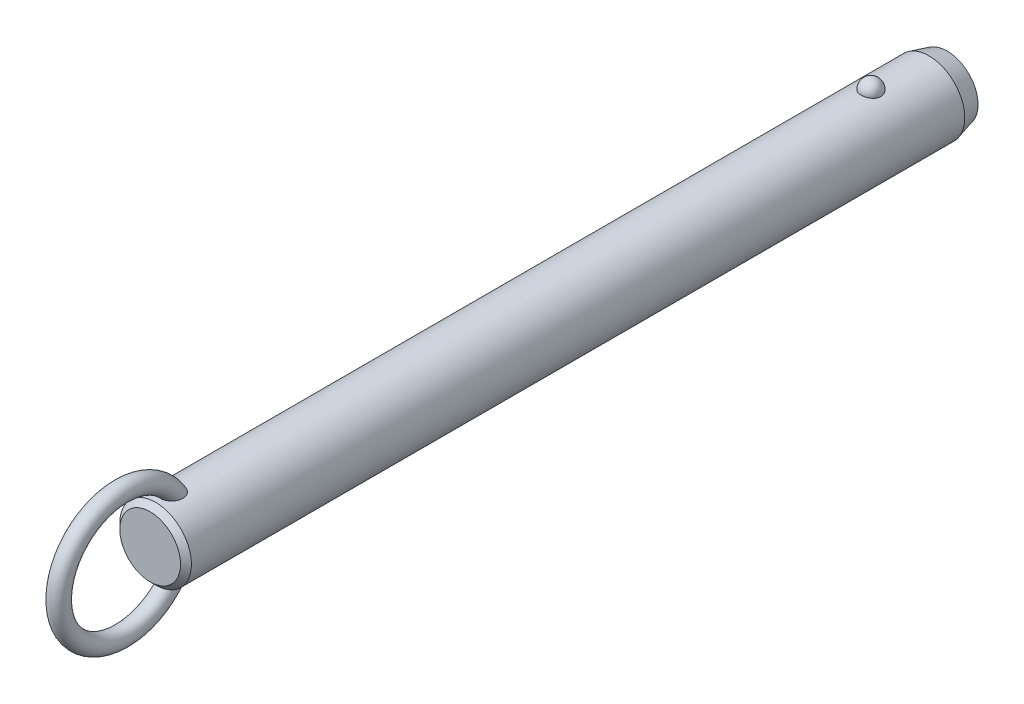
ISO-10303-21;
HEADER;
FILE_DESCRIPTION(('STEP AP214'),'2;1');
FILE_NAME('part.step','',(''),(''),'','','');
FILE_SCHEMA(('AUTOMOTIVE_DESIGN { 1 0 10303 214 1 1 1 1 }'));
ENDSEC;
DATA;
#1=APPLICATION_CONTEXT('core data for automotive mechanical design processes');
#2=APPLICATION_PROTOCOL_DEFINITION('international standard','automotive_design',2000,#1);
#3=PRODUCT_CONTEXT('',#1,'mechanical');
#4=PRODUCT('Part','Part','',(#3));
#5=PRODUCT_RELATED_PRODUCT_CATEGORY('part','',(#4));
#6=PRODUCT_DEFINITION_FORMATION('','',#4);
#7=PRODUCT_DEFINITION_CONTEXT('part definition',#1,'design');
#8=PRODUCT_DEFINITION('design','',#6,#7);
#9=PRODUCT_DEFINITION_SHAPE('','',#8);
#10=(LENGTH_UNIT() NAMED_UNIT(*) SI_UNIT(.MILLI.,.METRE.));
#11=(NAMED_UNIT(*) PLANE_ANGLE_UNIT() SI_UNIT($,.RADIAN.));
#12=(NAMED_UNIT(*) SI_UNIT($,.STERADIAN.) SOLID_ANGLE_UNIT());
#13=UNCERTAINTY_MEASURE_WITH_UNIT(LENGTH_MEASURE(1.E-05),#10,'distance_accuracy_value','');
#14=(GEOMETRIC_REPRESENTATION_CONTEXT(3) GLOBAL_UNCERTAINTY_ASSIGNED_CONTEXT((#13)) GLOBAL_UNIT_ASSIGNED_CONTEXT((#10,
#11,#12)) REPRESENTATION_CONTEXT('',''));
#15=CARTESIAN_POINT('',(0.,0.,0.));
#16=DIRECTION('',(0.,0.,1.));
#17=DIRECTION('',(1.,0.,0.));
#18=AXIS2_PLACEMENT_3D('',#15,#16,#17);
#19=CARTESIAN_POINT('',(0.,0.,147.3));
#20=DIRECTION('',(0.,0.,-1.));
#21=DIRECTION('',(-1.,0.,0.));
#22=AXIS2_PLACEMENT_3D('',#19,#20,#21);
#23=CYLINDRICAL_SURFACE('',#22,7.9);
#24=CARTESIAN_POINT('',(2.1785689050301,7.59367088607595,-2.19999999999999));
#25=CARTESIAN_POINT('',(2.17856679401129,7.59367269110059,-2.07701843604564));
#26=CARTESIAN_POINT('',(2.16853481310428,7.59657145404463,-1.95401006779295));
#27=CARTESIAN_POINT('',(2.12864689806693,7.607843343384,-1.71147811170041));
#28=CARTESIAN_POINT('',(2.09878338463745,7.61621856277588,-1.59195587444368));
#29=CARTESIAN_POINT('',(2.0199931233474,7.63749180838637,-1.3598563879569));
#30=CARTESIAN_POINT('',(1.97107475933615,7.6503878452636,-1.24727610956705));
#31=CARTESIAN_POINT('',(1.85539377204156,7.67926115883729,-1.03213234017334));
#32=CARTESIAN_POINT('',(1.78863158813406,7.69523835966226,-0.929568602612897));
#33=CARTESIAN_POINT('',(1.63856494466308,7.7285848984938,-0.736786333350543));
#34=CARTESIAN_POINT('',(1.55518140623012,7.7459606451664,-0.646630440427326));
#35=CARTESIAN_POINT('',(1.37422937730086,7.78009978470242,-0.481747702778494));
#36=CARTESIAN_POINT('',(1.27666086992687,7.79686317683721,-0.407020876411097));
#37=CARTESIAN_POINT('',(1.07024728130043,7.82786153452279,-0.275278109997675));
#38=CARTESIAN_POINT('',(0.961434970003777,7.84210353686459,-0.218212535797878));
#39=CARTESIAN_POINT('',(0.735351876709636,7.86652194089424,-0.123146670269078));
#40=CARTESIAN_POINT('',(0.618082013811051,7.87669878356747,-0.085144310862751));
#41=CARTESIAN_POINT('',(0.380637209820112,7.89170521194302,-0.0298158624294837));
#42=CARTESIAN_POINT('',(0.260550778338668,7.89662650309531,-0.0121347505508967));
#43=CARTESIAN_POINT('',(0.0190117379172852,7.90090003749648,0.00324379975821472));
#44=CARTESIAN_POINT('',(-0.102440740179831,7.90025280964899,0.00094313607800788));
#45=CARTESIAN_POINT('',(-0.341452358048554,7.89351056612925,-0.0233955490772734));
#46=CARTESIAN_POINT('',(-0.459042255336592,7.88749257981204,-0.0451545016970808));
#47=CARTESIAN_POINT('',(-0.688796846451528,7.87075812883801,-0.107408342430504));
#48=CARTESIAN_POINT('',(-0.800961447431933,7.86004158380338,-0.147903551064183));
#49=CARTESIAN_POINT('',(-1.01743634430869,7.83497131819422,-0.246799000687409));
#50=CARTESIAN_POINT('',(-1.12169791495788,7.82059709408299,-0.305300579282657));
#51=CARTESIAN_POINT('',(-1.31891765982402,7.78976470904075,-0.438549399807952));
#52=CARTESIAN_POINT('',(-1.41187469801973,7.77330633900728,-0.513298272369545));
#53=CARTESIAN_POINT('',(-1.58577142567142,7.73972434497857,-0.678622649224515));
#54=CARTESIAN_POINT('',(-1.66645140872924,7.72259402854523,-0.769470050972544));
#55=CARTESIAN_POINT('',(-1.81161503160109,7.68983776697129,-0.963538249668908));
#56=CARTESIAN_POINT('',(-1.87609753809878,7.6742119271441,-1.06675991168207));
#57=CARTESIAN_POINT('',(-1.98790138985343,7.6460202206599,-1.28401170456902));
#58=CARTESIAN_POINT('',(-2.03501994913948,7.63349104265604,-1.39815107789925));
#59=CARTESIAN_POINT('',(-2.10986724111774,7.6131449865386,-1.63301784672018));
#60=CARTESIAN_POINT('',(-2.1375965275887,7.60532797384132,-1.75374505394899));
#61=CARTESIAN_POINT('',(-2.17289256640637,7.5953195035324,-1.99782562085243));
#62=CARTESIAN_POINT('',(-2.18054294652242,7.59310471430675,-2.12116592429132));
#63=CARTESIAN_POINT('',(-2.17572919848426,7.59448538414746,-2.36741799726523));
#64=CARTESIAN_POINT('',(-2.1632656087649,7.59808068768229,-2.49032977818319));
#65=CARTESIAN_POINT('',(-2.11865035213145,7.61064035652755,-2.73161015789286));
#66=CARTESIAN_POINT('',(-2.08659579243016,7.61957823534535,-2.84999812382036));
#67=CARTESIAN_POINT('',(-2.00367799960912,7.64179982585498,-3.07955956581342));
#68=CARTESIAN_POINT('',(-1.9528140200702,7.65508371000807,-3.19073275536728));
#69=CARTESIAN_POINT('',(-1.83321113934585,7.68460381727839,-3.40337899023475));
#70=CARTESIAN_POINT('',(-1.76437735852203,7.70085556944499,-3.50479651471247));
#71=CARTESIAN_POINT('',(-1.61069526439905,7.73445734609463,-3.69446912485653));
#72=CARTESIAN_POINT('',(-1.52584634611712,7.75180741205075,-3.78272371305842));
#73=CARTESIAN_POINT('',(-1.34198059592,7.78574608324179,-3.94393987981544));
#74=CARTESIAN_POINT('',(-1.24291308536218,7.80233167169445,-4.01684434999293));
#75=CARTESIAN_POINT('',(-1.03352039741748,7.83281625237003,-4.14489386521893));
#76=CARTESIAN_POINT('',(-0.92319600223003,7.84671543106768,-4.20004014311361));
#77=CARTESIAN_POINT('',(-0.695822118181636,7.87011575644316,-4.29042017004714));
#78=CARTESIAN_POINT('',(-0.578872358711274,7.87966903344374,-4.32589112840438));
#79=CARTESIAN_POINT('',(-0.340410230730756,7.8935652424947,-4.37692226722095));
#80=CARTESIAN_POINT('',(-0.218898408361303,7.89790879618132,-4.39248482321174));
#81=CARTESIAN_POINT('',(0.0228107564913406,7.90087453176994,-4.40314405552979));
#82=CARTESIAN_POINT('',(0.142990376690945,7.89960185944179,-4.39861683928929));
#83=CARTESIAN_POINT('',(0.380829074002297,7.89171262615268,-4.37008293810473));
#84=CARTESIAN_POINT('',(0.498488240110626,7.8850962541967,-4.34607694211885));
#85=CARTESIAN_POINT('',(0.727535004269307,7.86726442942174,-4.27939317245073));
#86=CARTESIAN_POINT('',(0.838944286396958,7.85606616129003,-4.236785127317));
#87=CARTESIAN_POINT('',(1.05295421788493,7.83025654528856,-4.13408348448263));
#88=CARTESIAN_POINT('',(1.15555431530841,7.81564498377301,-4.07398879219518));
#89=CARTESIAN_POINT('',(1.35076763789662,7.7843022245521,-3.93687432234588));
#90=CARTESIAN_POINT('',(1.4432046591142,7.76754209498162,-3.85961036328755));
#91=CARTESIAN_POINT('',(1.6139111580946,7.73387857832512,-3.69076949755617));
#92=CARTESIAN_POINT('',(1.6921781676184,7.71697516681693,-3.59919010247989));
#93=CARTESIAN_POINT('',(1.83380875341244,7.6845643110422,-3.40247278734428));
#94=CARTESIAN_POINT('',(1.89689280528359,7.66908588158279,-3.29712873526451));
#95=CARTESIAN_POINT('',(2.0047823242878,7.64159441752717,-3.07707931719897));
#96=CARTESIAN_POINT('',(2.0495945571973,7.62958010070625,-2.96237743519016));
#97=CARTESIAN_POINT('',(2.11580183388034,7.61146617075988,-2.74040519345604));
#98=CARTESIAN_POINT('',(2.13929812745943,7.60484503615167,-2.63379846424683));
#99=CARTESIAN_POINT('',(2.17068242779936,7.59594664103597,-2.41813481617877));
#100=CARTESIAN_POINT('',(2.17857077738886,7.59366928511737,-2.30907795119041));
#101=CARTESIAN_POINT('',(2.1785689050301,7.59367088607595,-2.19999999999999));
#102=B_SPLINE_CURVE_WITH_KNOTS('',3,(#24,#25,#26,#27,#28,#29,#30,#31,#32,#33,#34,#35,#36,#37,
#38,#39,#40,#41,#42,#43,#44,#45,#46,#47,#48,#49,#50,#51,#52,#53,#54,#55,#56,#57,#58,#59,#60,#61,
#62,#63,#64,#65,#66,#67,#68,#69,#70,#71,#72,#73,#74,#75,#76,#77,#78,#79,#80,#81,#82,#83,#84,#85,
#86,#87,#88,#89,#90,#91,#92,#93,#94,#95,#96,#97,#98,#99,#100,#101),.UNSPECIFIED.,.T.,.F.,(4,2,2,
2,2,2,2,2,2,2,2,2,2,2,2,2,2,2,2,2,2,2,2,2,2,2,2,2,2,2,2,2,2,2,2,2,2,2,4),(0.,0.368552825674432,
0.737246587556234,1.10577831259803,1.4743009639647,1.8446206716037,2.21494081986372,
2.5842105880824,2.95344028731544,3.31611630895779,3.67875788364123,4.03628044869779,
4.39380913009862,4.75338791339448,5.11300280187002,5.47939989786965,5.8458226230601,
6.21639834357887,6.58696347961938,6.95598276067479,7.32499216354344,7.69218715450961,
8.0593967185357,8.42858578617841,8.79778880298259,9.16834203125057,9.5388695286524,
9.90482699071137,10.2707407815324,10.6298333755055,10.9889132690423,11.3466585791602,
11.7044262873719,12.0676511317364,12.4309391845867,12.8004764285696,13.1698767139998,
13.4967701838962,13.8236564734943),.UNSPECIFIED.);
#103=CARTESIAN_POINT('',(2.1785689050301,7.59367088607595,-2.19999999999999));
#104=VERTEX_POINT('',#103);
#105=EDGE_CURVE('E41',#104,#104,#102,.T.);
#106=ORIENTED_EDGE('',*,*,#105,.T.);
#107=EDGE_LOOP('',(#106));
#108=FACE_BOUND('',#107,.T.);
#109=CARTESIAN_POINT('',(0.,0.,155.62));
#110=DIRECTION('',(0.,0.,1.));
#111=DIRECTION('',(1.,0.,0.));
#112=AXIS2_PLACEMENT_3D('',#109,#110,#111);
#113=CIRCLE('',#112,7.9);
#114=CARTESIAN_POINT('',(7.9,0.,155.62));
#115=VERTEX_POINT('',#114);
#116=EDGE_CURVE('E10',#115,#115,#113,.F.);
#117=ORIENTED_EDGE('',*,*,#116,.T.);
#118=EDGE_LOOP('',(#117));
#119=FACE_BOUND('',#118,.T.);
#120=CARTESIAN_POINT('',(-0.630969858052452,-7.87476203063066,149.512432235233));
#121=CARTESIAN_POINT('',(-0.734180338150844,-7.86648998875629,149.547285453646));
#122=CARTESIAN_POINT('',(-0.834476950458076,-7.85639291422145,149.590816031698));
#123=CARTESIAN_POINT('',(-1.02620356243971,-7.83366343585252,149.694094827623));
#124=CARTESIAN_POINT('',(-1.1176141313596,-7.82102565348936,149.753877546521));
#125=CARTESIAN_POINT('',(-1.28877277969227,-7.79464922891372,149.887839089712));
#126=CARTESIAN_POINT('',(-1.36854014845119,-7.7809124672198,149.961993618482));
#127=CARTESIAN_POINT('',(-1.51461521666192,-7.75380398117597,150.122494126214));
#128=CARTESIAN_POINT('',(-1.58092966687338,-7.74043207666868,150.208833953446));
#129=CARTESIAN_POINT('',(-1.70019064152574,-7.7151252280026,150.392978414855));
#130=CARTESIAN_POINT('',(-1.75284037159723,-7.70322473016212,150.490979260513));
#131=CARTESIAN_POINT('',(-1.84263464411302,-7.68224112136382,150.694102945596));
#132=CARTESIAN_POINT('',(-1.87977299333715,-7.6731591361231,150.799228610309));
#133=CARTESIAN_POINT('',(-1.94152728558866,-7.65777930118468,151.023284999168));
#134=CARTESIAN_POINT('',(-1.96475471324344,-7.65179654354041,151.142616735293));
#135=CARTESIAN_POINT('',(-1.99449499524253,-7.64409642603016,151.38342986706));
#136=CARTESIAN_POINT('',(-2.0010005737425,-7.64238092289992,151.504912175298));
#137=CARTESIAN_POINT('',(-1.99856014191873,-7.64302120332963,151.768340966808));
#138=CARTESIAN_POINT('',(-1.98680021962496,-7.64611845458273,151.91025654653));
#139=CARTESIAN_POINT('',(-1.94457772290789,-7.65696186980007,152.191118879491));
#140=CARTESIAN_POINT('',(-1.91409393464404,-7.66471330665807,152.330062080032));
#141=CARTESIAN_POINT('',(-1.82768670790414,-7.68582947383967,152.631939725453));
#142=CARTESIAN_POINT('',(-1.76772963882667,-7.70003779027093,152.793686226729));
#143=CARTESIAN_POINT('',(-1.65998501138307,-7.72371550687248,153.027695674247));
#144=CARTESIAN_POINT('',(-1.621079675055,-7.73200670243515,153.104297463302));
#145=CARTESIAN_POINT('',(-1.53727726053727,-7.74910377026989,153.254079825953));
#146=CARTESIAN_POINT('',(-1.49238215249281,-7.75790947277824,153.327261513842));
#147=CARTESIAN_POINT('',(-1.37397050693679,-7.77993338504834,153.50288382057));
#148=CARTESIAN_POINT('',(-1.29690364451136,-7.79328473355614,153.602955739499));
#149=CARTESIAN_POINT('',(-1.1288548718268,-7.81939266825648,153.790714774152));
#150=CARTESIAN_POINT('',(-1.0378992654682,-7.83215032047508,153.878424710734));
#151=CARTESIAN_POINT('',(-0.86953281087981,-7.85231710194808,154.013414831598));
#152=CARTESIAN_POINT('',(-0.795716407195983,-7.86021093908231,154.065076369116));
#153=CARTESIAN_POINT('',(-0.640813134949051,-7.87434920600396,154.156381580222));
#154=CARTESIAN_POINT('',(-0.559737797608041,-7.88059619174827,154.19604389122));
#155=CARTESIAN_POINT('',(-0.406456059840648,-7.88984116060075,154.254300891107));
#156=CARTESIAN_POINT('',(-0.335227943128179,-7.89321892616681,154.275384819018));
#157=CARTESIAN_POINT('',(-0.190193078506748,-7.89804235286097,154.30541418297));
#158=CARTESIAN_POINT('',(-0.11638863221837,-7.89948969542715,154.314370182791));
#159=CARTESIAN_POINT('',(0.0318414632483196,-7.90028409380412,154.319291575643));
#160=CARTESIAN_POINT('',(0.106268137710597,-7.89962640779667,154.315227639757));
#161=CARTESIAN_POINT('',(0.253290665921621,-7.8962818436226,154.294461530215));
#162=CARTESIAN_POINT('',(0.325885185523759,-7.8935935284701,154.277750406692));
#163=CARTESIAN_POINT('',(0.481441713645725,-7.88577340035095,154.228738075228));
#164=CARTESIAN_POINT('',(0.563611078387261,-7.88026321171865,154.194005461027));
#165=CARTESIAN_POINT('',(0.721129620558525,-7.86741729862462,154.111796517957));
#166=CARTESIAN_POINT('',(0.796466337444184,-7.86007832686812,154.064297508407));
#167=CARTESIAN_POINT('',(0.971456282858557,-7.84073285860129,153.936513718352));
#168=CARTESIAN_POINT('',(1.06719686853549,-7.82809461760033,153.851004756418));
#169=CARTESIAN_POINT('',(1.24418921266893,-7.80192439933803,153.666232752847));
#170=CARTESIAN_POINT('',(1.32540832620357,-7.78839049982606,153.566939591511));
#171=CARTESIAN_POINT('',(1.45199971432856,-7.76559693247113,153.389576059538));
#172=CARTESIAN_POINT('',(1.50085649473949,-7.75626094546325,153.313954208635));
#173=CARTESIAN_POINT('',(1.59197749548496,-7.7380727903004,153.158742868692));
#174=CARTESIAN_POINT('',(1.63423919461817,-7.72922080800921,153.079151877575));
#175=CARTESIAN_POINT('',(1.71222612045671,-7.71231959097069,152.916664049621));
#176=CARTESIAN_POINT('',(1.74794516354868,-7.70427111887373,152.833764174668));
#177=CARTESIAN_POINT('',(1.81270113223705,-7.68929240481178,152.6652967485));
#178=CARTESIAN_POINT('',(1.84173789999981,-7.68236218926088,152.579729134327));
#179=CARTESIAN_POINT('',(1.89322698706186,-7.6698375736,152.40528702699));
#180=CARTESIAN_POINT('',(1.91558744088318,-7.66426199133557,152.316383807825));
#181=CARTESIAN_POINT('',(1.95281367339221,-7.65485915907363,152.136969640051));
#182=CARTESIAN_POINT('',(1.96767946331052,-7.65103190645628,152.046458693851));
#183=CARTESIAN_POINT('',(2.00021456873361,-7.64262981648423,151.773732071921));
#184=CARTESIAN_POINT('',(2.00600691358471,-7.6410871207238,151.589709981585));
#185=CARTESIAN_POINT('',(1.98445334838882,-7.64669564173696,151.276501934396));
#186=CARTESIAN_POINT('',(1.96607186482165,-7.65149688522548,151.146618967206));
#187=CARTESIAN_POINT('',(1.90884967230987,-7.6659762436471,150.891632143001));
#188=CARTESIAN_POINT('',(1.87002101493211,-7.67565148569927,150.766525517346));
#189=CARTESIAN_POINT('',(1.77063986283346,-7.69918471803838,150.52454013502));
#190=CARTESIAN_POINT('',(1.70993724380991,-7.71307150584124,150.407725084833));
#191=CARTESIAN_POINT('',(1.56733070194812,-7.74330306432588,150.188144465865));
#192=CARTESIAN_POINT('',(1.48543692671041,-7.75964665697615,150.085372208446));
#193=CARTESIAN_POINT('',(1.31346177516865,-7.79047523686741,149.909380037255));
#194=CARTESIAN_POINT('',(1.22547278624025,-7.80495298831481,149.834106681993));
#195=CARTESIAN_POINT('',(1.03724352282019,-7.83218597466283,149.700486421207));
#196=CARTESIAN_POINT('',(0.937008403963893,-7.84494192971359,149.642132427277));
#197=CARTESIAN_POINT('',(0.733599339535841,-7.86649045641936,149.547027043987));
#198=CARTESIAN_POINT('',(0.630941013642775,-7.87547134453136,149.509210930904));
#199=CARTESIAN_POINT('',(0.420465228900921,-7.88950708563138,149.451116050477));
#200=CARTESIAN_POINT('',(0.312645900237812,-7.89456050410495,149.43084369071));
#201=CARTESIAN_POINT('',(0.0960869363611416,-7.9001518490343,149.408455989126));
#202=CARTESIAN_POINT('',(-0.012634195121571,-7.90073226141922,149.406169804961));
#203=CARTESIAN_POINT('',(-0.228766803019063,-7.89742350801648,149.419367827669));
#204=CARTESIAN_POINT('',(-0.336180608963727,-7.89354403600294,149.434813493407));
#205=CARTESIAN_POINT('',(-0.473410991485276,-7.88586871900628,149.466217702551));
#206=CARTESIAN_POINT('',(-0.505257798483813,-7.88388984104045,149.474354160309));
#207=CARTESIAN_POINT('',(-0.568481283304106,-7.87958326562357,149.492208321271));
#208=CARTESIAN_POINT('',(-0.599857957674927,-7.87725556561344,149.501926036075));
#209=CARTESIAN_POINT('',(-0.630969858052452,-7.87476203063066,149.512432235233));
#210=B_SPLINE_CURVE_WITH_KNOTS('',3,(#120,#121,#122,#123,#124,#125,#126,#127,#128,#129,#130,
#131,#132,#133,#134,#135,#136,#137,#138,#139,#140,#141,#142,#143,#144,#145,#146,#147,#148,#149,
#150,#151,#152,#153,#154,#155,#156,#157,#158,#159,#160,#161,#162,#163,#164,#165,#166,#167,#168,
#169,#170,#171,#172,#173,#174,#175,#176,#177,#178,#179,#180,#181,#182,#183,#184,#185,#186,#187,
#188,#189,#190,#191,#192,#193,#194,#195,#196,#197,#198,#199,#200,#201,#202,#203,#204,#205,#206,
#207,#208,#209),.UNSPECIFIED.,.T.,.F.,(4,2,2,2,2,2,2,2,2,2,2,2,2,2,2,2,2,2,2,2,2,2,2,2,2,2,2,2,
2,2,2,2,2,2,2,2,2,2,2,2,2,2,2,2,4),(0.,0.327622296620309,0.655945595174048,0.98371863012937,
1.3113267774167,1.64554655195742,1.97989964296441,2.34365728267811,2.70757317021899,
3.13333684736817,3.55958380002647,4.07655306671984,4.33527897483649,4.59391999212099,
4.97382437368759,5.353017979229,5.62348245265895,5.89352465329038,6.11565959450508,
6.33760092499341,6.56004255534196,6.78264174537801,7.0493084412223,7.31645206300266,
7.70130871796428,8.08701995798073,8.35824509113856,8.62957365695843,8.90115735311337,
9.1727474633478,9.44791855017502,9.72308922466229,10.2715298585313,10.6638393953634,
11.0559179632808,11.4507403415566,11.8453740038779,12.1936425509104,12.5417649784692,
12.8695063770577,13.1973674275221,13.5221104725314,13.8461490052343,13.9449071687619,
14.0436660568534),.UNSPECIFIED.);
#211=CARTESIAN_POINT('',(-0.630969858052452,-7.87476203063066,149.512432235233));
#212=VERTEX_POINT('',#211);
#213=EDGE_CURVE('E59',#212,#212,#210,.T.);
#214=ORIENTED_EDGE('',*,*,#213,.T.);
#215=EDGE_LOOP('',(#214));
#216=FACE_BOUND('',#215,.T.);
#217=CARTESIAN_POINT('',(-0.630969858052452,7.87476203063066,149.512432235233));
#218=CARTESIAN_POINT('',(-0.52891882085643,7.88293636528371,149.477979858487));
#219=CARTESIAN_POINT('',(-0.423745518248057,7.88934810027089,149.451915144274));
#220=CARTESIAN_POINT('',(-0.210236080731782,7.8979273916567,149.417282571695));
#221=CARTESIAN_POINT('',(-0.101893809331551,7.90008607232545,149.408751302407));
#222=CARTESIAN_POINT('',(0.11466056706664,7.89990877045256,149.409457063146));
#223=CARTESIAN_POINT('',(0.222872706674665,7.89757640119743,149.41867980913));
#224=CARTESIAN_POINT('',(0.436107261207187,7.88867538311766,149.454652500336));
#225=CARTESIAN_POINT('',(0.541131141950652,7.8821087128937,149.48139425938));
#226=CARTESIAN_POINT('',(0.745085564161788,7.86545130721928,149.551756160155));
#227=CARTESIAN_POINT('',(0.844015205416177,7.85536005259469,149.595378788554));
#228=CARTESIAN_POINT('',(1.03299167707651,7.83275153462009,149.698379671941));
#229=CARTESIAN_POINT('',(1.12303841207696,7.8202342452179,149.757758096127));
#230=CARTESIAN_POINT('',(1.29214734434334,7.79408219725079,149.890864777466));
#231=CARTESIAN_POINT('',(1.37116907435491,7.78044359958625,149.964643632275));
#232=CARTESIAN_POINT('',(1.51597677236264,7.75353170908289,150.124235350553));
#233=CARTESIAN_POINT('',(1.58176261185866,7.74025841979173,150.210048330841));
#234=CARTESIAN_POINT('',(1.70057386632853,7.71504069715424,150.393644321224));
#235=CARTESIAN_POINT('',(1.75320073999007,7.7031425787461,150.491690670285));
#236=CARTESIAN_POINT('',(1.8429376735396,7.68216822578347,150.694893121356));
#237=CARTESIAN_POINT('',(1.88004278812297,7.67309289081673,150.800051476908));
#238=CARTESIAN_POINT('',(1.9417232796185,7.6577294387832,151.024167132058));
#239=CARTESIAN_POINT('',(1.96491037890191,7.65175648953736,151.143524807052));
#240=CARTESIAN_POINT('',(1.9945689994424,7.64407702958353,151.384384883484));
#241=CARTESIAN_POINT('',(2.00103304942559,7.64237242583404,151.50588821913));
#242=CARTESIAN_POINT('',(1.99850166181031,7.64303650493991,151.769368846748));
#243=CARTESIAN_POINT('',(1.98669038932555,7.64614714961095,151.911314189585));
#244=CARTESIAN_POINT('',(1.94436120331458,7.6570170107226,152.192228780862));
#245=CARTESIAN_POINT('',(1.91382203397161,7.66478150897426,152.331194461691));
#246=CARTESIAN_POINT('',(1.82728754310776,7.68592483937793,152.633111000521));
#247=CARTESIAN_POINT('',(1.76725778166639,7.7001468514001,152.794872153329));
#248=CARTESIAN_POINT('',(1.65939700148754,7.72384204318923,153.028891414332));
#249=CARTESIAN_POINT('',(1.62045187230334,7.73213852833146,153.105494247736));
#250=CARTESIAN_POINT('',(1.53656684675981,7.74924489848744,153.255273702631));
#251=CARTESIAN_POINT('',(1.49162892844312,7.75805461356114,153.328451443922));
#252=CARTESIAN_POINT('',(1.37317698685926,7.78007342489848,153.503952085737));
#253=CARTESIAN_POINT('',(1.29612360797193,7.79341423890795,153.603911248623));
#254=CARTESIAN_POINT('',(1.12812043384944,7.81949839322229,153.79145083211));
#255=CARTESIAN_POINT('',(1.03719688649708,7.83224280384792,153.879054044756));
#256=CARTESIAN_POINT('',(0.868871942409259,7.85239026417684,154.01389715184));
#257=CARTESIAN_POINT('',(0.795056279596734,7.86027769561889,154.065511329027));
#258=CARTESIAN_POINT('',(0.640160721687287,7.87440222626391,154.156720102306));
#259=CARTESIAN_POINT('',(0.559092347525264,7.88064188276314,154.196333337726));
#260=CARTESIAN_POINT('',(0.405820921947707,7.8898738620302,154.254505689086));
#261=CARTESIAN_POINT('',(0.334594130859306,7.89324577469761,154.275552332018));
#262=CARTESIAN_POINT('',(0.189568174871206,7.89805733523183,154.305507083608));
#263=CARTESIAN_POINT('',(0.115771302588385,7.89949866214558,154.314425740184));
#264=CARTESIAN_POINT('',(-0.0324359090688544,7.90028156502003,154.31927589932));
#265=CARTESIAN_POINT('',(-0.106847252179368,7.89961843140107,154.315178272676));
#266=CARTESIAN_POINT('',(-0.253834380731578,7.8962642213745,154.294351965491));
#267=CARTESIAN_POINT('',(-0.326408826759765,7.89357170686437,154.277614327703));
#268=CARTESIAN_POINT('',(-0.481962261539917,7.88574179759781,154.228539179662));
#269=CARTESIAN_POINT('',(-0.564145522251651,7.88022507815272,154.193763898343));
#270=CARTESIAN_POINT('',(-0.7216852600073,7.86736646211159,154.111468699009));
#271=CARTESIAN_POINT('',(-0.797029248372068,7.8600213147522,154.063926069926));
#272=CARTESIAN_POINT('',(-0.97204426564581,7.84066026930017,153.936026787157));
#273=CARTESIAN_POINT('',(-1.0677980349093,7.828012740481,153.850443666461));
#274=CARTESIAN_POINT('',(-1.24480531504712,7.80182621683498,153.665522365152));
#275=CARTESIAN_POINT('',(-1.32602618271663,7.78828530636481,153.566154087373));
#276=CARTESIAN_POINT('',(-1.45259834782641,7.76548487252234,153.388680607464));
#277=CARTESIAN_POINT('',(-1.50143856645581,7.75614818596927,153.313025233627));
#278=CARTESIAN_POINT('',(-1.5925241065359,7.73796020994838,153.157748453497));
#279=CARTESIAN_POINT('',(-1.63476690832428,7.729109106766,153.078125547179));
#280=CARTESIAN_POINT('',(-1.71271318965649,7.71221133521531,152.915575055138));
#281=CARTESIAN_POINT('',(-1.74841047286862,7.70416543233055,152.832644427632));
#282=CARTESIAN_POINT('',(-1.81311929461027,7.6891937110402,152.664116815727));
#283=CARTESIAN_POINT('',(-1.84213067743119,7.68226791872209,152.578519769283));
#284=CARTESIAN_POINT('',(-1.89356259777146,7.66975461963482,152.404025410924));
#285=CARTESIAN_POINT('',(-1.91589165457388,7.66418586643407,152.315099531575));
#286=CARTESIAN_POINT('',(-1.9530507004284,7.65479859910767,152.135642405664));
#287=CARTESIAN_POINT('',(-1.96788069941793,7.65098008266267,152.045111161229));
#288=CARTESIAN_POINT('',(-2.00030078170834,7.64260704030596,151.772327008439));
#289=CARTESIAN_POINT('',(-2.00600576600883,7.64108760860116,151.588271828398));
#290=CARTESIAN_POINT('',(-1.9842848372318,7.64673945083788,151.275080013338));
#291=CARTESIAN_POINT('',(-1.96583698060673,7.65155751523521,151.145240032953));
#292=CARTESIAN_POINT('',(-1.90848948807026,7.66606613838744,150.890361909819));
#293=CARTESIAN_POINT('',(-1.86960376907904,7.67575338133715,150.765320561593));
#294=CARTESIAN_POINT('',(-1.77013421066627,7.6993013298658,150.523500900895));
#295=CARTESIAN_POINT('',(-1.70940488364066,7.71318991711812,150.406784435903));
#296=CARTESIAN_POINT('',(-1.5667295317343,7.74342495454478,150.187340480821));
#297=CARTESIAN_POINT('',(-1.48478316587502,7.75977144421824,150.08461321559));
#298=CARTESIAN_POINT('',(-1.31266325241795,7.79061163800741,149.908643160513));
#299=CARTESIAN_POINT('',(-1.22456383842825,7.80509908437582,149.833358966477));
#300=CARTESIAN_POINT('',(-1.03622400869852,7.83231881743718,149.699865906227));
#301=CARTESIAN_POINT('',(-0.936015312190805,7.84505551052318,149.641613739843));
#302=CARTESIAN_POINT('',(-0.798824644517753,7.85957802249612,149.577540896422));
#303=CARTESIAN_POINT('',(-0.765787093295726,7.86286821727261,149.563224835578));
#304=CARTESIAN_POINT('',(-0.698939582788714,7.86909211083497,149.536436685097));
#305=CARTESIAN_POINT('',(-0.665129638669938,7.8720258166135,149.523964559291));
#306=CARTESIAN_POINT('',(-0.630969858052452,7.87476203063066,149.512432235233));
#307=B_SPLINE_CURVE_WITH_KNOTS('',3,(#217,#218,#219,#220,#221,#222,#223,#224,#225,#226,#227,
#228,#229,#230,#231,#232,#233,#234,#235,#236,#237,#238,#239,#240,#241,#242,#243,#244,#245,#246,
#247,#248,#249,#250,#251,#252,#253,#254,#255,#256,#257,#258,#259,#260,#261,#262,#263,#264,#265,
#266,#267,#268,#269,#270,#271,#272,#273,#274,#275,#276,#277,#278,#279,#280,#281,#282,#283,#284,
#285,#286,#287,#288,#289,#290,#291,#292,#293,#294,#295,#296,#297,#298,#299,#300,#301,#302,#303,
#304,#305,#306),.UNSPECIFIED.,.T.,.F.,(4,2,2,2,2,2,2,2,2,2,2,2,2,2,2,2,2,2,2,2,2,2,2,2,2,2,2,2,
2,2,2,2,2,2,2,2,2,2,2,2,2,2,2,2,4),(0.,0.32392037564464,0.648516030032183,0.972850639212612,
1.29703380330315,1.62126473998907,1.94549915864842,2.27089401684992,2.59629203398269,
2.93059633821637,3.26500707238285,3.6288164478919,3.99278833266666,4.41865421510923,
4.84500434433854,5.36209210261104,5.62087589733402,5.87957448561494,6.25918598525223,
6.63808782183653,6.90846748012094,7.17842501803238,7.40052350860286,7.6224287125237,
7.84483086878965,8.0673907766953,8.33414615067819,8.60137921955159,8.98641454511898,
9.37230415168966,9.64358673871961,9.91497268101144,10.1866142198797,10.4582620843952,
10.7334745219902,11.008686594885,11.5572126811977,11.9494246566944,12.3413699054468,
12.7359755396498,13.1305875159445,13.4791770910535,13.82687259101,13.9353013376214,
14.0437279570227),.UNSPECIFIED.);
#308=CARTESIAN_POINT('',(-0.630969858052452,7.87476203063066,149.512432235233));
#309=VERTEX_POINT('',#308);
#310=EDGE_CURVE('E67',#309,#309,#307,.T.);
#311=ORIENTED_EDGE('',*,*,#310,.T.);
#312=EDGE_LOOP('',(#311));
#313=FACE_BOUND('',#312,.T.);
#314=CARTESIAN_POINT('',(0.,0.,-14.9999999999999));
#315=DIRECTION('',(0.,0.,-1.));
#316=DIRECTION('',(-1.,0.,0.));
#317=AXIS2_PLACEMENT_3D('',#314,#315,#316);
#318=CIRCLE('',#317,7.9);
#319=CARTESIAN_POINT('',(-7.9,0.,-14.9999999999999));
#320=VERTEX_POINT('',#319);
#321=EDGE_CURVE('E56',#320,#320,#318,.F.);
#322=ORIENTED_EDGE('',*,*,#321,.T.);
#323=EDGE_LOOP('',(#322));
#324=FACE_BOUND('',#323,.T.);
#325=ADVANCED_FACE('F37',(#108,#119,#216,#313,#324),#23,.T.);
#326=CARTESIAN_POINT('',(0.,0.,-19.));
#327=DIRECTION('',(0.,0.,-1.));
#328=DIRECTION('',(-1.,0.,0.));
#329=AXIS2_PLACEMENT_3D('',#326,#327,#328);
#330=PLANE('',#329);
#331=CARTESIAN_POINT('',(0.,0.,-19.));
#332=DIRECTION('',(0.,0.,-1.));
#333=DIRECTION('',(-1.,0.,0.));
#334=AXIS2_PLACEMENT_3D('',#331,#332,#333);
#335=CIRCLE('',#334,6.8282032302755);
#336=CARTESIAN_POINT('',(-6.8282032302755,0.,-19.));
#337=VERTEX_POINT('',#336);
#338=EDGE_CURVE('E66',#337,#337,#335,.T.);
#339=ORIENTED_EDGE('',*,*,#338,.T.);
#340=EDGE_LOOP('',(#339));
#341=FACE_BOUND('',#340,.T.);
#342=ADVANCED_FACE('F85',(#341),#330,.T.);
#343=CARTESIAN_POINT('',(0.,0.,-19.));
#344=DIRECTION('',(0.,0.,1.));
#345=DIRECTION('',(1.,0.,0.));
#346=AXIS2_PLACEMENT_3D('',#343,#344,#345);
#347=CONICAL_SURFACE('',#346,6.8282032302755,0.261799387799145);
#348=ORIENTED_EDGE('',*,*,#321,.F.);
#349=EDGE_LOOP('',(#348));
#350=FACE_BOUND('',#349,.T.);
#351=ORIENTED_EDGE('',*,*,#338,.F.);
#352=EDGE_LOOP('',(#351));
#353=FACE_BOUND('',#352,.T.);
#354=ADVANCED_FACE('F83',(#350,#353),#347,.T.);
#355=CARTESIAN_POINT('',(0.,0.,156.82));
#356=DIRECTION('',(0.,0.,1.));
#357=DIRECTION('',(1.,0.,0.));
#358=AXIS2_PLACEMENT_3D('',#355,#356,#357);
#359=PLANE('',#358);
#360=CARTESIAN_POINT('',(0.,0.,156.82));
#361=DIRECTION('',(0.,0.,1.));
#362=DIRECTION('',(1.,0.,0.));
#363=AXIS2_PLACEMENT_3D('',#360,#361,#362);
#364=CIRCLE('',#363,6.69999999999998);
#365=CARTESIAN_POINT('',(6.69999999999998,0.,156.82));
#366=VERTEX_POINT('',#365);
#367=EDGE_CURVE('E50',#366,#366,#364,.T.);
#368=ORIENTED_EDGE('',*,*,#367,.T.);
#369=EDGE_LOOP('',(#368));
#370=FACE_BOUND('',#369,.T.);
#371=ADVANCED_FACE('F77',(#370),#359,.T.);
#372=CARTESIAN_POINT('',(0.,0.,163.15));
#373=DIRECTION('',(1.,0.,0.));
#374=DIRECTION('',(0.,0.,-1.));
#375=AXIS2_PLACEMENT_3D('',#372,#373,#374);
#376=TOROIDAL_SURFACE('',#375,13.85,2.);
#377=ORIENTED_EDGE('',*,*,#310,.F.);
#378=EDGE_LOOP('',(#377));
#379=FACE_BOUND('',#378,.T.);
#380=ORIENTED_EDGE('',*,*,#213,.F.);
#381=EDGE_LOOP('',(#380));
#382=FACE_BOUND('',#381,.T.);
#383=ADVANCED_FACE('F73',(#379,#382),#376,.T.);
#384=CARTESIAN_POINT('',(0.,0.,156.82));
#385=DIRECTION('',(0.,0.,-1.));
#386=DIRECTION('',(-1.,0.,0.));
#387=AXIS2_PLACEMENT_3D('',#384,#385,#386);
#388=CONICAL_SURFACE('',#387,6.69999999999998,0.785398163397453);
#389=ORIENTED_EDGE('',*,*,#116,.F.);
#390=EDGE_LOOP('',(#389));
#391=FACE_BOUND('',#390,.T.);
#392=ORIENTED_EDGE('',*,*,#367,.F.);
#393=EDGE_LOOP('',(#392));
#394=FACE_BOUND('',#393,.T.);
#395=ADVANCED_FACE('F39',(#391,#394),#388,.T.);
#396=CARTESIAN_POINT('',(0.,7.9,-2.19999999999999));
#397=DIRECTION('',(0.,1.,0.));
#398=DIRECTION('',(0.,0.,-1.));
#399=AXIS2_PLACEMENT_3D('',#396,#397,#398);
#400=SPHERICAL_SURFACE('',#399,2.2);
#401=ORIENTED_EDGE('',*,*,#105,.F.);
#402=EDGE_LOOP('',(#401));
#403=FACE_BOUND('',#402,.T.);
#404=ADVANCED_FACE('F79',(#403),#400,.T.);
#405=CLOSED_SHELL('',(#325,#342,#354,#371,#383,#395,#404));
#406=MANIFOLD_SOLID_BREP('B2',#405);
#407=ADVANCED_BREP_SHAPE_REPRESENTATION('',(#18,#406),#14);
#408=SHAPE_DEFINITION_REPRESENTATION(#9,#407);
ENDSEC;
END-ISO-10303-21;
